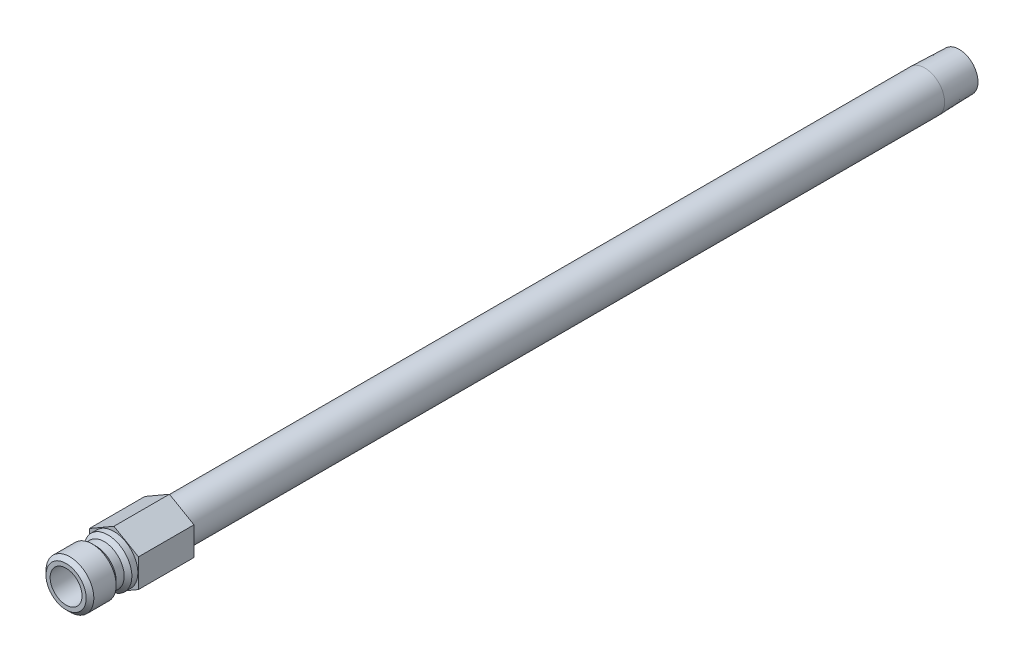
ISO-10303-21;
HEADER;
FILE_DESCRIPTION(('STEP AP214'),'2;1');
FILE_NAME('part.step','',(''),(''),'','','');
FILE_SCHEMA(('AUTOMOTIVE_DESIGN { 1 0 10303 214 1 1 1 1 }'));
ENDSEC;
DATA;
#1=APPLICATION_CONTEXT('core data for automotive mechanical design processes');
#2=APPLICATION_PROTOCOL_DEFINITION('international standard','automotive_design',2000,#1);
#3=PRODUCT_CONTEXT('',#1,'mechanical');
#4=PRODUCT('Part','Part','',(#3));
#5=PRODUCT_RELATED_PRODUCT_CATEGORY('part','',(#4));
#6=PRODUCT_DEFINITION_FORMATION('','',#4);
#7=PRODUCT_DEFINITION_CONTEXT('part definition',#1,'design');
#8=PRODUCT_DEFINITION('design','',#6,#7);
#9=PRODUCT_DEFINITION_SHAPE('','',#8);
#10=(LENGTH_UNIT() NAMED_UNIT(*) SI_UNIT(.MILLI.,.METRE.));
#11=(NAMED_UNIT(*) PLANE_ANGLE_UNIT() SI_UNIT($,.RADIAN.));
#12=(NAMED_UNIT(*) SI_UNIT($,.STERADIAN.) SOLID_ANGLE_UNIT());
#13=UNCERTAINTY_MEASURE_WITH_UNIT(LENGTH_MEASURE(1.E-05),#10,'distance_accuracy_value','');
#14=(GEOMETRIC_REPRESENTATION_CONTEXT(3) GLOBAL_UNCERTAINTY_ASSIGNED_CONTEXT((#13)) GLOBAL_UNIT_ASSIGNED_CONTEXT((#10,
#11,#12)) REPRESENTATION_CONTEXT('',''));
#15=CARTESIAN_POINT('',(0.,0.,0.));
#16=DIRECTION('',(0.,0.,1.));
#17=DIRECTION('',(1.,0.,0.));
#18=AXIS2_PLACEMENT_3D('',#15,#16,#17);
#19=CARTESIAN_POINT('',(0.,0.,0.));
#20=DIRECTION('',(0.,0.,-1.));
#21=DIRECTION('',(0.,1.,0.));
#22=AXIS2_PLACEMENT_3D('',#19,#20,#21);
#23=CYLINDRICAL_SURFACE('',#22,3.175);
#24=CARTESIAN_POINT('',(0.,0.,0.));
#25=DIRECTION('',(0.,0.,1.));
#26=DIRECTION('',(1.,0.,0.));
#27=AXIS2_PLACEMENT_3D('',#24,#25,#26);
#28=CIRCLE('',#27,3.175);
#29=CARTESIAN_POINT('',(3.175,0.,0.));
#30=VERTEX_POINT('',#29);
#31=EDGE_CURVE('E11',#30,#30,#28,.T.);
#32=ORIENTED_EDGE('',*,*,#31,.F.);
#33=EDGE_LOOP('',(#32));
#34=FACE_BOUND('',#33,.T.);
#35=CARTESIAN_POINT('',(0.,0.,9.525));
#36=DIRECTION('',(0.,0.,-1.));
#37=DIRECTION('',(0.,1.,0.));
#38=AXIS2_PLACEMENT_3D('',#35,#36,#37);
#39=CIRCLE('',#38,3.175);
#40=CARTESIAN_POINT('',(0.,3.175,9.525));
#41=VERTEX_POINT('',#40);
#42=EDGE_CURVE('E37',#41,#41,#39,.T.);
#43=ORIENTED_EDGE('',*,*,#42,.F.);
#44=EDGE_LOOP('',(#43));
#45=FACE_BOUND('',#44,.T.);
#46=ADVANCED_FACE('F34',(#34,#45),#23,.F.);
#47=CARTESIAN_POINT('',(0.,3.175,9.525));
#48=DIRECTION('',(0.,0.,1.));
#49=DIRECTION('',(0.,-1.,0.));
#50=AXIS2_PLACEMENT_3D('',#47,#48,#49);
#51=PLANE('',#50);
#52=ORIENTED_EDGE('',*,*,#42,.T.);
#53=EDGE_LOOP('',(#52));
#54=FACE_BOUND('',#53,.T.);
#55=CARTESIAN_POINT('',(0.,0.,9.525));
#56=DIRECTION('',(0.,0.,-1.));
#57=DIRECTION('',(0.,1.,0.));
#58=AXIS2_PLACEMENT_3D('',#55,#56,#57);
#59=CIRCLE('',#58,4.0005);
#60=CARTESIAN_POINT('',(0.,4.0005,9.525));
#61=VERTEX_POINT('',#60);
#62=EDGE_CURVE('E174',#61,#61,#59,.T.);
#63=ORIENTED_EDGE('',*,*,#62,.F.);
#64=EDGE_LOOP('',(#63));
#65=FACE_BOUND('',#64,.T.);
#66=ADVANCED_FACE('F181',(#54,#65),#51,.T.);
#67=CARTESIAN_POINT('',(0.,0.,8.763));
#68=DIRECTION('',(0.,0.,-1.));
#69=DIRECTION('',(0.,1.,0.));
#70=AXIS2_PLACEMENT_3D('',#67,#68,#69);
#71=CONICAL_SURFACE('',#70,4.7625,0.785398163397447);
#72=ORIENTED_EDGE('',*,*,#62,.T.);
#73=EDGE_LOOP('',(#72));
#74=FACE_BOUND('',#73,.T.);
#75=CARTESIAN_POINT('',(0.,0.,8.763));
#76=DIRECTION('',(0.,0.,-1.));
#77=DIRECTION('',(0.,1.,0.));
#78=AXIS2_PLACEMENT_3D('',#75,#76,#77);
#79=CIRCLE('',#78,4.7625);
#80=CARTESIAN_POINT('',(0.,4.7625,8.763));
#81=VERTEX_POINT('',#80);
#82=EDGE_CURVE('E172',#81,#81,#79,.T.);
#83=ORIENTED_EDGE('',*,*,#82,.F.);
#84=EDGE_LOOP('',(#83));
#85=FACE_BOUND('',#84,.T.);
#86=ADVANCED_FACE('F189',(#74,#85),#71,.T.);
#87=CARTESIAN_POINT('',(0.,0.,0.));
#88=DIRECTION('',(0.,0.,-1.));
#89=DIRECTION('',(0.,1.,0.));
#90=AXIS2_PLACEMENT_3D('',#87,#88,#89);
#91=CYLINDRICAL_SURFACE('',#90,4.7625);
#92=ORIENTED_EDGE('',*,*,#82,.T.);
#93=EDGE_LOOP('',(#92));
#94=FACE_BOUND('',#93,.T.);
#95=CARTESIAN_POINT('',(0.,0.,4.318));
#96=DIRECTION('',(0.,0.,-1.));
#97=DIRECTION('',(0.,1.,0.));
#98=AXIS2_PLACEMENT_3D('',#95,#96,#97);
#99=CIRCLE('',#98,4.7625);
#100=CARTESIAN_POINT('',(0.,4.7625,4.318));
#101=VERTEX_POINT('',#100);
#102=EDGE_CURVE('E169',#101,#101,#99,.T.);
#103=ORIENTED_EDGE('',*,*,#102,.F.);
#104=EDGE_LOOP('',(#103));
#105=FACE_BOUND('',#104,.T.);
#106=ADVANCED_FACE('F255',(#94,#105),#91,.T.);
#107=CARTESIAN_POINT('',(0.,0.,3.556));
#108=DIRECTION('',(0.,0.,1.));
#109=DIRECTION('',(0.,-1.,0.));
#110=AXIS2_PLACEMENT_3D('',#107,#108,#109);
#111=CONICAL_SURFACE('',#110,4.0005,0.785398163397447);
#112=ORIENTED_EDGE('',*,*,#102,.T.);
#113=EDGE_LOOP('',(#112));
#114=FACE_BOUND('',#113,.T.);
#115=CARTESIAN_POINT('',(0.,0.,3.556));
#116=DIRECTION('',(0.,0.,-1.));
#117=DIRECTION('',(0.,1.,0.));
#118=AXIS2_PLACEMENT_3D('',#115,#116,#117);
#119=CIRCLE('',#118,4.0005);
#120=CARTESIAN_POINT('',(0.,4.0005,3.556));
#121=VERTEX_POINT('',#120);
#122=EDGE_CURVE('E166',#121,#121,#119,.T.);
#123=ORIENTED_EDGE('',*,*,#122,.F.);
#124=EDGE_LOOP('',(#123));
#125=FACE_BOUND('',#124,.T.);
#126=ADVANCED_FACE('F251',(#114,#125),#111,.T.);
#127=CARTESIAN_POINT('',(0.,0.,0.));
#128=DIRECTION('',(0.,0.,-1.));
#129=DIRECTION('',(0.,1.,0.));
#130=AXIS2_PLACEMENT_3D('',#127,#128,#129);
#131=CYLINDRICAL_SURFACE('',#130,4.0005);
#132=ORIENTED_EDGE('',*,*,#122,.T.);
#133=EDGE_LOOP('',(#132));
#134=FACE_BOUND('',#133,.T.);
#135=CARTESIAN_POINT('',(0.,0.,1.9558));
#136=DIRECTION('',(0.,0.,-1.));
#137=DIRECTION('',(0.,1.,0.));
#138=AXIS2_PLACEMENT_3D('',#135,#136,#137);
#139=CIRCLE('',#138,4.0005);
#140=CARTESIAN_POINT('',(0.,4.0005,1.9558));
#141=VERTEX_POINT('',#140);
#142=EDGE_CURVE('E163',#141,#141,#139,.T.);
#143=ORIENTED_EDGE('',*,*,#142,.F.);
#144=EDGE_LOOP('',(#143));
#145=FACE_BOUND('',#144,.T.);
#146=ADVANCED_FACE('F247',(#134,#145),#131,.T.);
#147=CARTESIAN_POINT('',(0.,0.,1.1938));
#148=DIRECTION('',(0.,0.,-1.));
#149=DIRECTION('',(0.,1.,0.));
#150=AXIS2_PLACEMENT_3D('',#147,#148,#149);
#151=CONICAL_SURFACE('',#150,4.7625,0.785398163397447);
#152=ORIENTED_EDGE('',*,*,#142,.T.);
#153=EDGE_LOOP('',(#152));
#154=FACE_BOUND('',#153,.T.);
#155=CARTESIAN_POINT('',(0.,0.,1.1938));
#156=DIRECTION('',(0.,0.,-1.));
#157=DIRECTION('',(0.,1.,0.));
#158=AXIS2_PLACEMENT_3D('',#155,#156,#157);
#159=CIRCLE('',#158,4.7625);
#160=CARTESIAN_POINT('',(0.,4.7625,1.1938));
#161=VERTEX_POINT('',#160);
#162=EDGE_CURVE('E160',#161,#161,#159,.T.);
#163=ORIENTED_EDGE('',*,*,#162,.F.);
#164=EDGE_LOOP('',(#163));
#165=FACE_BOUND('',#164,.T.);
#166=ADVANCED_FACE('F243',(#154,#165),#151,.T.);
#167=CARTESIAN_POINT('',(0.,0.,0.));
#168=DIRECTION('',(0.,0.,-1.));
#169=DIRECTION('',(0.,1.,0.));
#170=AXIS2_PLACEMENT_3D('',#167,#168,#169);
#171=CYLINDRICAL_SURFACE('',#170,4.7625);
#172=ORIENTED_EDGE('',*,*,#162,.T.);
#173=EDGE_LOOP('',(#172));
#174=FACE_BOUND('',#173,.T.);
#175=CARTESIAN_POINT('',(0.,0.,0.));
#176=DIRECTION('',(0.,0.,-1.));
#177=DIRECTION('',(0.,1.,0.));
#178=AXIS2_PLACEMENT_3D('',#175,#176,#177);
#179=CIRCLE('',#178,4.7625);
#180=CARTESIAN_POINT('',(0.,4.7625,0.));
#181=VERTEX_POINT('',#180);
#182=EDGE_CURVE('E157',#181,#181,#179,.T.);
#183=ORIENTED_EDGE('',*,*,#182,.F.);
#184=EDGE_LOOP('',(#183));
#185=FACE_BOUND('',#184,.T.);
#186=ADVANCED_FACE('F196',(#174,#185),#171,.T.);
#187=CARTESIAN_POINT('',(-4.8895,2.82295414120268,0.));
#188=DIRECTION('',(0.,0.,1.));
#189=DIRECTION('',(1.,0.,0.));
#190=AXIS2_PLACEMENT_3D('',#187,#188,#189);
#191=PLANE('',#190);
#192=ORIENTED_EDGE('',*,*,#31,.T.);
#193=EDGE_LOOP('',(#192));
#194=FACE_BOUND('',#193,.T.);
#195=CARTESIAN_POINT('',(0.,0.,0.));
#196=DIRECTION('',(0.,0.,1.));
#197=DIRECTION('',(1.,0.,0.));
#198=AXIS2_PLACEMENT_3D('',#195,#196,#197);
#199=CIRCLE('',#198,2.38124999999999);
#200=CARTESIAN_POINT('',(2.38124999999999,0.,0.));
#201=VERTEX_POINT('',#200);
#202=EDGE_CURVE('E126',#201,#201,#199,.T.);
#203=ORIENTED_EDGE('',*,*,#202,.F.);
#204=EDGE_LOOP('',(#203));
#205=FACE_BOUND('',#204,.T.);
#206=ADVANCED_FACE('F192',(#194,#205),#191,.T.);
#207=CARTESIAN_POINT('',(0.,0.,-168.275));
#208=DIRECTION('',(0.,0.,1.));
#209=DIRECTION('',(0.,-1.,0.));
#210=AXIS2_PLACEMENT_3D('',#207,#208,#209);
#211=CONICAL_SURFACE('',#210,3.75443877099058,0.0312396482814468);
#212=CARTESIAN_POINT('',(0.,0.,-161.417));
#213=DIRECTION('',(0.,0.,-1.));
#214=DIRECTION('',(0.,1.,0.));
#215=AXIS2_PLACEMENT_3D('',#212,#213,#214);
#216=CIRCLE('',#215,3.96874999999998);
#217=CARTESIAN_POINT('',(0.,3.96875,-161.417));
#218=VERTEX_POINT('',#217);
#219=EDGE_CURVE('E154',#218,#218,#216,.T.);
#220=ORIENTED_EDGE('',*,*,#219,.T.);
#221=EDGE_LOOP('',(#220));
#222=FACE_BOUND('',#221,.T.);
#223=CARTESIAN_POINT('',(0.,0.,-168.275));
#224=DIRECTION('',(0.,0.,-1.));
#225=DIRECTION('',(0.,1.,0.));
#226=AXIS2_PLACEMENT_3D('',#223,#224,#225);
#227=CIRCLE('',#226,3.75443877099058);
#228=CARTESIAN_POINT('',(0.,3.7544387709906,-168.275));
#229=VERTEX_POINT('',#228);
#230=EDGE_CURVE('E151',#229,#229,#227,.T.);
#231=ORIENTED_EDGE('',*,*,#230,.F.);
#232=EDGE_LOOP('',(#231));
#233=FACE_BOUND('',#232,.T.);
#234=ADVANCED_FACE('F195',(#222,#233),#211,.T.);
#235=CARTESIAN_POINT('',(0.,0.,0.));
#236=DIRECTION('',(0.,0.,-1.));
#237=DIRECTION('',(0.,1.,0.));
#238=AXIS2_PLACEMENT_3D('',#235,#236,#237);
#239=CYLINDRICAL_SURFACE('',#238,3.96874999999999);
#240=ORIENTED_EDGE('',*,*,#219,.F.);
#241=EDGE_LOOP('',(#240));
#242=FACE_BOUND('',#241,.T.);
#243=CARTESIAN_POINT('',(0.,0.,-11.049));
#244=DIRECTION('',(0.,0.,1.));
#245=DIRECTION('',(1.,0.,0.));
#246=AXIS2_PLACEMENT_3D('',#243,#244,#245);
#247=CIRCLE('',#246,3.96874999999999);
#248=CARTESIAN_POINT('',(3.96874999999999,0.,-11.049));
#249=VERTEX_POINT('',#248);
#250=EDGE_CURVE('E140',#249,#249,#247,.F.);
#251=ORIENTED_EDGE('',*,*,#250,.T.);
#252=EDGE_LOOP('',(#251));
#253=FACE_BOUND('',#252,.T.);
#254=ADVANCED_FACE('F233',(#242,#253),#239,.T.);
#255=CARTESIAN_POINT('',(0.,3.7544387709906,-168.275));
#256=DIRECTION('',(0.,0.,-1.));
#257=DIRECTION('',(0.,1.,0.));
#258=AXIS2_PLACEMENT_3D('',#255,#256,#257);
#259=PLANE('',#258);
#260=ORIENTED_EDGE('',*,*,#230,.T.);
#261=EDGE_LOOP('',(#260));
#262=FACE_BOUND('',#261,.T.);
#263=CARTESIAN_POINT('',(0.,0.,-168.275));
#264=DIRECTION('',(0.,0.,-1.));
#265=DIRECTION('',(0.,1.,0.));
#266=AXIS2_PLACEMENT_3D('',#263,#264,#265);
#267=CIRCLE('',#266,2.38124999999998);
#268=CARTESIAN_POINT('',(0.,2.38125,-168.275));
#269=VERTEX_POINT('',#268);
#270=EDGE_CURVE('E147',#269,#269,#267,.T.);
#271=ORIENTED_EDGE('',*,*,#270,.F.);
#272=EDGE_LOOP('',(#271));
#273=FACE_BOUND('',#272,.T.);
#274=ADVANCED_FACE('F230',(#262,#273),#259,.T.);
#275=CARTESIAN_POINT('',(0.,0.,0.));
#276=DIRECTION('',(0.,0.,-1.));
#277=DIRECTION('',(0.,1.,0.));
#278=AXIS2_PLACEMENT_3D('',#275,#276,#277);
#279=CYLINDRICAL_SURFACE('',#278,2.38124999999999);
#280=ORIENTED_EDGE('',*,*,#202,.T.);
#281=EDGE_LOOP('',(#280));
#282=FACE_BOUND('',#281,.T.);
#283=ORIENTED_EDGE('',*,*,#270,.T.);
#284=EDGE_LOOP('',(#283));
#285=FACE_BOUND('',#284,.T.);
#286=ADVANCED_FACE('F216',(#282,#285),#279,.F.);
#287=CARTESIAN_POINT('',(0.,5.64590828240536,-11.049));
#288=DIRECTION('',(-0.5,0.866025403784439,0.));
#289=DIRECTION('',(-0.866025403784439,-0.5,0.));
#290=AXIS2_PLACEMENT_3D('',#287,#288,#289);
#291=PLANE('',#290);
#292=DIRECTION('',(-0.866025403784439,-0.5,0.));
#293=VECTOR('',#292,1.);
#294=CARTESIAN_POINT('',(0.,5.64590828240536,0.));
#295=LINE('',#294,#293);
#296=CARTESIAN_POINT('',(0.,5.64590828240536,0.));
#297=VERTEX_POINT('',#296);
#298=CARTESIAN_POINT('',(-4.8895,2.82295414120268,0.));
#299=VERTEX_POINT('',#298);
#300=EDGE_CURVE('E122',#297,#299,#295,.T.);
#301=ORIENTED_EDGE('',*,*,#300,.F.);
#302=DIRECTION('',(0.,0.,1.));
#303=VECTOR('',#302,1.);
#304=CARTESIAN_POINT('',(0.,5.64590828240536,-11.049));
#305=LINE('',#304,#303);
#306=CARTESIAN_POINT('',(0.,5.64590828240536,-11.049));
#307=VERTEX_POINT('',#306);
#308=EDGE_CURVE('E51',#307,#297,#305,.T.);
#309=ORIENTED_EDGE('',*,*,#308,.F.);
#310=DIRECTION('',(-0.866025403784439,-0.5,0.));
#311=VECTOR('',#310,1.);
#312=CARTESIAN_POINT('',(0.,5.64590828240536,-11.049));
#313=LINE('',#312,#311);
#314=CARTESIAN_POINT('',(-4.8895,2.82295414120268,-11.049));
#315=VERTEX_POINT('',#314);
#316=EDGE_CURVE('E138',#307,#315,#313,.T.);
#317=ORIENTED_EDGE('',*,*,#316,.T.);
#318=DIRECTION('',(0.,0.,1.));
#319=VECTOR('',#318,1.);
#320=CARTESIAN_POINT('',(-4.8895,2.82295414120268,-11.049));
#321=LINE('',#320,#319);
#322=EDGE_CURVE('E86',#315,#299,#321,.T.);
#323=ORIENTED_EDGE('',*,*,#322,.T.);
#324=EDGE_LOOP('',(#301,#309,#317,#323));
#325=FACE_BOUND('',#324,.T.);
#326=ADVANCED_FACE('F206',(#325),#291,.T.);
#327=CARTESIAN_POINT('',(4.8895,2.82295414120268,-11.049));
#328=DIRECTION('',(0.5,0.866025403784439,0.));
#329=DIRECTION('',(-0.866025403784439,0.5,0.));
#330=AXIS2_PLACEMENT_3D('',#327,#328,#329);
#331=PLANE('',#330);
#332=DIRECTION('',(-0.866025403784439,0.5,0.));
#333=VECTOR('',#332,1.);
#334=CARTESIAN_POINT('',(4.8895,2.82295414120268,0.));
#335=LINE('',#334,#333);
#336=CARTESIAN_POINT('',(4.8895,2.82295414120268,0.));
#337=VERTEX_POINT('',#336);
#338=EDGE_CURVE('E135',#337,#297,#335,.T.);
#339=ORIENTED_EDGE('',*,*,#338,.F.);
#340=DIRECTION('',(0.,0.,1.));
#341=VECTOR('',#340,1.);
#342=CARTESIAN_POINT('',(4.8895,2.82295414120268,-11.049));
#343=LINE('',#342,#341);
#344=CARTESIAN_POINT('',(4.8895,2.82295414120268,-11.049));
#345=VERTEX_POINT('',#344);
#346=EDGE_CURVE('E74',#345,#337,#343,.T.);
#347=ORIENTED_EDGE('',*,*,#346,.F.);
#348=DIRECTION('',(-0.866025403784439,0.5,0.));
#349=VECTOR('',#348,1.);
#350=CARTESIAN_POINT('',(4.8895,2.82295414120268,-11.049));
#351=LINE('',#350,#349);
#352=EDGE_CURVE('E112',#345,#307,#351,.T.);
#353=ORIENTED_EDGE('',*,*,#352,.T.);
#354=ORIENTED_EDGE('',*,*,#308,.T.);
#355=EDGE_LOOP('',(#339,#347,#353,#354));
#356=FACE_BOUND('',#355,.T.);
#357=ADVANCED_FACE('F208',(#356),#331,.T.);
#358=CARTESIAN_POINT('',(4.8895,-2.82295414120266,-11.049));
#359=DIRECTION('',(1.,0.,0.));
#360=DIRECTION('',(0.,0.,-1.));
#361=AXIS2_PLACEMENT_3D('',#358,#359,#360);
#362=PLANE('',#361);
#363=DIRECTION('',(0.,1.,0.));
#364=VECTOR('',#363,1.);
#365=CARTESIAN_POINT('',(4.8895,-2.82295414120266,0.));
#366=LINE('',#365,#364);
#367=CARTESIAN_POINT('',(4.8895,-2.82295414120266,0.));
#368=VERTEX_POINT('',#367);
#369=EDGE_CURVE('E99',#368,#337,#366,.T.);
#370=ORIENTED_EDGE('',*,*,#369,.F.);
#371=DIRECTION('',(0.,0.,1.));
#372=VECTOR('',#371,1.);
#373=CARTESIAN_POINT('',(4.8895,-2.82295414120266,-11.049));
#374=LINE('',#373,#372);
#375=CARTESIAN_POINT('',(4.8895,-2.82295414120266,-11.049));
#376=VERTEX_POINT('',#375);
#377=EDGE_CURVE('E94',#376,#368,#374,.T.);
#378=ORIENTED_EDGE('',*,*,#377,.F.);
#379=DIRECTION('',(0.,1.,0.));
#380=VECTOR('',#379,1.);
#381=CARTESIAN_POINT('',(4.8895,-2.82295414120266,-11.049));
#382=LINE('',#381,#380);
#383=EDGE_CURVE('E97',#376,#345,#382,.T.);
#384=ORIENTED_EDGE('',*,*,#383,.T.);
#385=ORIENTED_EDGE('',*,*,#346,.T.);
#386=EDGE_LOOP('',(#370,#378,#384,#385));
#387=FACE_BOUND('',#386,.T.);
#388=ADVANCED_FACE('F96',(#387),#362,.T.);
#389=CARTESIAN_POINT('',(0.,-5.64590828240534,-11.049));
#390=DIRECTION('',(0.5,-0.866025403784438,0.));
#391=DIRECTION('',(0.866025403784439,0.5,0.));
#392=AXIS2_PLACEMENT_3D('',#389,#390,#391);
#393=PLANE('',#392);
#394=DIRECTION('',(0.866025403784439,0.5,0.));
#395=VECTOR('',#394,1.);
#396=CARTESIAN_POINT('',(0.,-5.64590828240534,0.));
#397=LINE('',#396,#395);
#398=CARTESIAN_POINT('',(0.,-5.64590828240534,0.));
#399=VERTEX_POINT('',#398);
#400=EDGE_CURVE('E132',#399,#368,#397,.T.);
#401=ORIENTED_EDGE('',*,*,#400,.F.);
#402=DIRECTION('',(0.,0.,1.));
#403=VECTOR('',#402,1.);
#404=CARTESIAN_POINT('',(0.,-5.64590828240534,-11.049));
#405=LINE('',#404,#403);
#406=CARTESIAN_POINT('',(0.,-5.64590828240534,-11.049));
#407=VERTEX_POINT('',#406);
#408=EDGE_CURVE('E104',#407,#399,#405,.T.);
#409=ORIENTED_EDGE('',*,*,#408,.F.);
#410=DIRECTION('',(0.866025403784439,0.5,0.));
#411=VECTOR('',#410,1.);
#412=CARTESIAN_POINT('',(0.,-5.64590828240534,-11.049));
#413=LINE('',#412,#411);
#414=EDGE_CURVE('E110',#407,#376,#413,.T.);
#415=ORIENTED_EDGE('',*,*,#414,.T.);
#416=ORIENTED_EDGE('',*,*,#377,.T.);
#417=EDGE_LOOP('',(#401,#409,#415,#416));
#418=FACE_BOUND('',#417,.T.);
#419=ADVANCED_FACE('F114',(#418),#393,.T.);
#420=CARTESIAN_POINT('',(-4.8895,-2.82295414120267,-11.049));
#421=DIRECTION('',(-0.5,-0.866025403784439,0.));
#422=DIRECTION('',(0.866025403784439,-0.5,0.));
#423=AXIS2_PLACEMENT_3D('',#420,#421,#422);
#424=PLANE('',#423);
#425=DIRECTION('',(0.866025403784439,-0.5,0.));
#426=VECTOR('',#425,1.);
#427=CARTESIAN_POINT('',(-4.8895,-2.82295414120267,0.));
#428=LINE('',#427,#426);
#429=CARTESIAN_POINT('',(-4.8895,-2.82295414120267,0.));
#430=VERTEX_POINT('',#429);
#431=EDGE_CURVE('E129',#430,#399,#428,.T.);
#432=ORIENTED_EDGE('',*,*,#431,.F.);
#433=DIRECTION('',(0.,0.,1.));
#434=VECTOR('',#433,1.);
#435=CARTESIAN_POINT('',(-4.8895,-2.82295414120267,-11.049));
#436=LINE('',#435,#434);
#437=CARTESIAN_POINT('',(-4.8895,-2.82295414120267,-11.049));
#438=VERTEX_POINT('',#437);
#439=EDGE_CURVE('E143',#438,#430,#436,.T.);
#440=ORIENTED_EDGE('',*,*,#439,.F.);
#441=DIRECTION('',(0.866025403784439,-0.5,0.));
#442=VECTOR('',#441,1.);
#443=CARTESIAN_POINT('',(-4.8895,-2.82295414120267,-11.049));
#444=LINE('',#443,#442);
#445=EDGE_CURVE('E115',#438,#407,#444,.T.);
#446=ORIENTED_EDGE('',*,*,#445,.T.);
#447=ORIENTED_EDGE('',*,*,#408,.T.);
#448=EDGE_LOOP('',(#432,#440,#446,#447));
#449=FACE_BOUND('',#448,.T.);
#450=ADVANCED_FACE('F222',(#449),#424,.T.);
#451=CARTESIAN_POINT('',(-4.8895,2.82295414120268,-11.049));
#452=DIRECTION('',(-1.,0.,0.));
#453=DIRECTION('',(0.,0.,1.));
#454=AXIS2_PLACEMENT_3D('',#451,#452,#453);
#455=PLANE('',#454);
#456=DIRECTION('',(0.,-1.,0.));
#457=VECTOR('',#456,1.);
#458=CARTESIAN_POINT('',(-4.8895,2.82295414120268,0.));
#459=LINE('',#458,#457);
#460=EDGE_CURVE('E125',#299,#430,#459,.T.);
#461=ORIENTED_EDGE('',*,*,#460,.F.);
#462=ORIENTED_EDGE('',*,*,#322,.F.);
#463=DIRECTION('',(0.,-1.,0.));
#464=VECTOR('',#463,1.);
#465=CARTESIAN_POINT('',(-4.8895,2.82295414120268,-11.049));
#466=LINE('',#465,#464);
#467=EDGE_CURVE('E117',#315,#438,#466,.T.);
#468=ORIENTED_EDGE('',*,*,#467,.T.);
#469=ORIENTED_EDGE('',*,*,#439,.T.);
#470=EDGE_LOOP('',(#461,#462,#468,#469));
#471=FACE_BOUND('',#470,.T.);
#472=ADVANCED_FACE('F204',(#471),#455,.T.);
#473=CARTESIAN_POINT('',(-4.8895,2.82295414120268,-11.049));
#474=DIRECTION('',(0.,0.,1.));
#475=DIRECTION('',(1.,0.,0.));
#476=AXIS2_PLACEMENT_3D('',#473,#474,#475);
#477=PLANE('',#476);
#478=ORIENTED_EDGE('',*,*,#250,.F.);
#479=EDGE_LOOP('',(#478));
#480=FACE_BOUND('',#479,.T.);
#481=ORIENTED_EDGE('',*,*,#316,.F.);
#482=ORIENTED_EDGE('',*,*,#352,.F.);
#483=ORIENTED_EDGE('',*,*,#383,.F.);
#484=ORIENTED_EDGE('',*,*,#414,.F.);
#485=ORIENTED_EDGE('',*,*,#445,.F.);
#486=ORIENTED_EDGE('',*,*,#467,.F.);
#487=EDGE_LOOP('',(#481,#482,#483,#484,#485,#486));
#488=FACE_BOUND('',#487,.T.);
#489=ADVANCED_FACE('F108',(#480,#488),#477,.F.);
#490=ORIENTED_EDGE('',*,*,#182,.T.);
#491=EDGE_LOOP('',(#490));
#492=FACE_BOUND('',#491,.T.);
#493=ORIENTED_EDGE('',*,*,#300,.T.);
#494=ORIENTED_EDGE('',*,*,#460,.T.);
#495=ORIENTED_EDGE('',*,*,#431,.T.);
#496=ORIENTED_EDGE('',*,*,#400,.T.);
#497=ORIENTED_EDGE('',*,*,#369,.T.);
#498=ORIENTED_EDGE('',*,*,#338,.T.);
#499=EDGE_LOOP('',(#493,#494,#495,#496,#497,#498));
#500=FACE_BOUND('',#499,.T.);
#501=ADVANCED_FACE('F198',(#492,#500),#191,.T.);
#502=CLOSED_SHELL('',(#46,#66,#86,#106,#126,#146,#166,#186,#206,#234,#254,#274,#286,#326,#357,
#388,#419,#450,#472,#489,#501));
#503=MANIFOLD_SOLID_BREP('B2',#502);
#504=ADVANCED_BREP_SHAPE_REPRESENTATION('',(#18,#503),#14);
#505=SHAPE_DEFINITION_REPRESENTATION(#9,#504);
ENDSEC;
END-ISO-10303-21;
